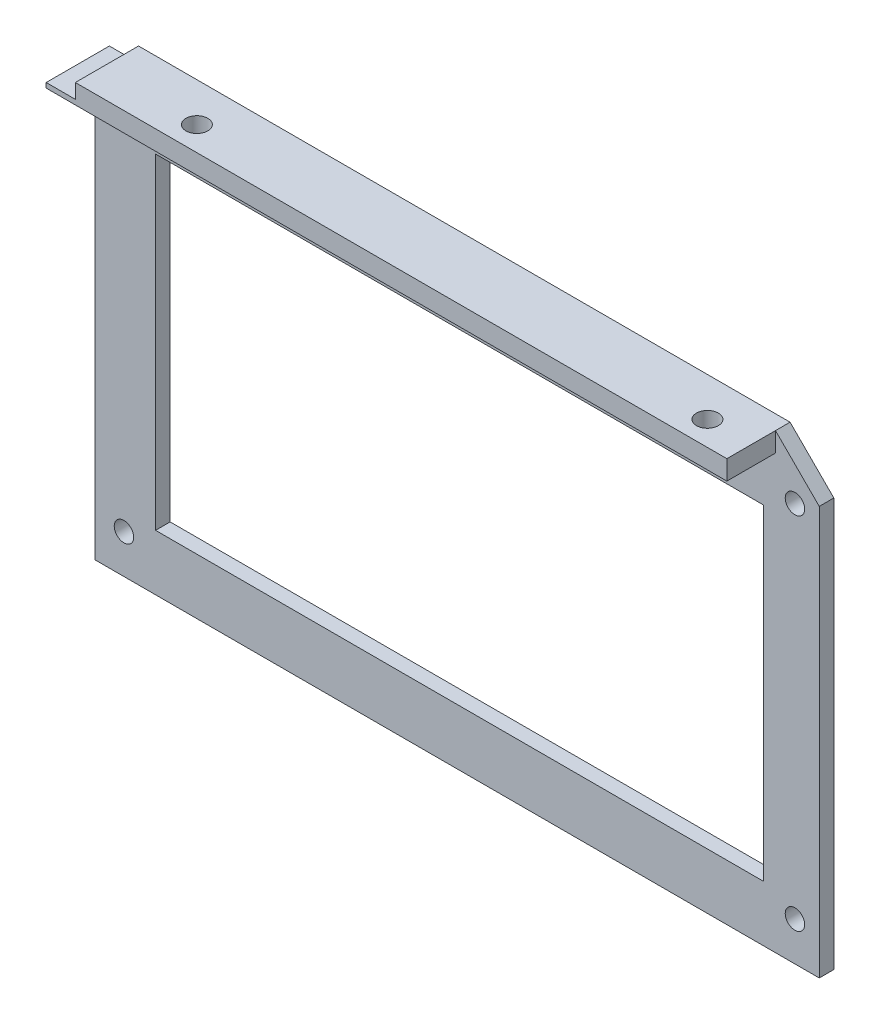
from build123d import *

# Parameters (mm, degrees)
SKETCH1_W           = 140
SKETCH1_H           = 13
SKETCH1_R           = 2.25
BOSS_EXTRUDE1_DEPTH = 4
SKETCH2_W           = 140
SKETCH2_H           = 89
BOSS_EXTRUDE2_DEPTH = 3
SKETCH3_W           = 125
SKETCH3_H           = 67.028985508
SKETCH3_R           = 2
CUT_EXTRUDE1_DEPTH  = 3
BOSS_EXTRUDE3_DEPTH = 40
CUT_EXTRUDE2_REACH  = 124.715
SKETCH6_W           = 6
SKETCH6_H           = 3
SKETCH8_R           = 4
CUT_EXTRUDE4_DEPTH  = 6


with BuildPart() as part:
    # Sketch1 → Boss-Extrude1 (new body)
    with BuildSketch(Plane(origin=(0, 0, 0), x_dir=(1, 0, 0), z_dir=(0, 1, 0))):
        Rectangle(SKETCH1_W, SKETCH1_H)
        with Locations(Location((61, -1.5, 0), (0, 0, 270))):
            Circle(SKETCH1_R, mode=Mode.SUBTRACT)
        with Locations(Location((-44, -1.5, 0), (0, 0, 270))):
            Circle(SKETCH1_R, mode=Mode.SUBTRACT)
    extrude(amount=-BOSS_EXTRUDE1_DEPTH)

    # Sketch2 → Boss-Extrude2 (add)
    with BuildSketch(Plane(origin=(0, 0, -6.5), x_dir=(-1, 0, 0), z_dir=(0, 0, -1))):
        with Locations((0, -48.5)):
            Rectangle(SKETCH2_W, SKETCH2_H)
        Polygon((-79, -93), (-79, -9), (-70, 0), (-70, -93), align=None)
    extrude(amount=-BOSS_EXTRUDE2_DEPTH)

    # Sketch3 → Cut-Extrude1 (cut)
    with BuildSketch(Plane(origin=(0, 0, -6.5), x_dir=(-1, 0, 0), z_dir=(0, 0, -1))):
        with Locations((-5, -48)):
            Rectangle(SKETCH3_W, SKETCH3_H)
        with Locations((64, -11)):
            Circle(SKETCH3_R)
        with Locations((-74, -11)):
            Circle(SKETCH3_R)
        with Locations((-74, -85)):
            Circle(SKETCH3_R)
        with Locations((64, -85)):
            Circle(SKETCH3_R)
    extrude(amount=-CUT_EXTRUDE1_DEPTH, mode=Mode.SUBTRACT)

    # Sketch4 → Boss-Extrude3 (add, symmetric)
    with BuildSketch(Plane.ZY.offset(-3.5)):
        Polygon((-3.5, -4), (-3.5, -8), (0.5, -4), align=None)
    extrude(amount=BOSS_EXTRUDE3_DEPTH, both=True)

    # Sketch6 → Cut-Extrude2 (cut, up to next)
    with BuildSketch(Plane(origin=(0, 0, -6.5), x_dir=(-1, 0, 0), z_dir=(0, 0, -1)), mode=Mode.PRIVATE) as cut_extrude2_sk1:
        with Locations((67, -1.5)):
            Rectangle(SKETCH6_W, SKETCH6_H)
    cut_extrude2_tool1 = extrude(cut_extrude2_sk1.sketch, amount=-CUT_EXTRUDE2_REACH, mode=Mode.PRIVATE) & part.part
    add(cut_extrude2_tool1.solids().sort_by_distance((-67, -1.5, -6.5))[0], mode=Mode.SUBTRACT)

    # Sketch8 → Cut-Extrude4 (cut)
    with BuildSketch(Plane.XY.offset(-3.5)):
        with Locations((-36.5, -8)):
            Circle(SKETCH8_R)
        with Locations((43.5, -8)):
            Circle(SKETCH8_R)
    extrude(amount=CUT_EXTRUDE4_DEPTH, mode=Mode.SUBTRACT)


solid = part.part
